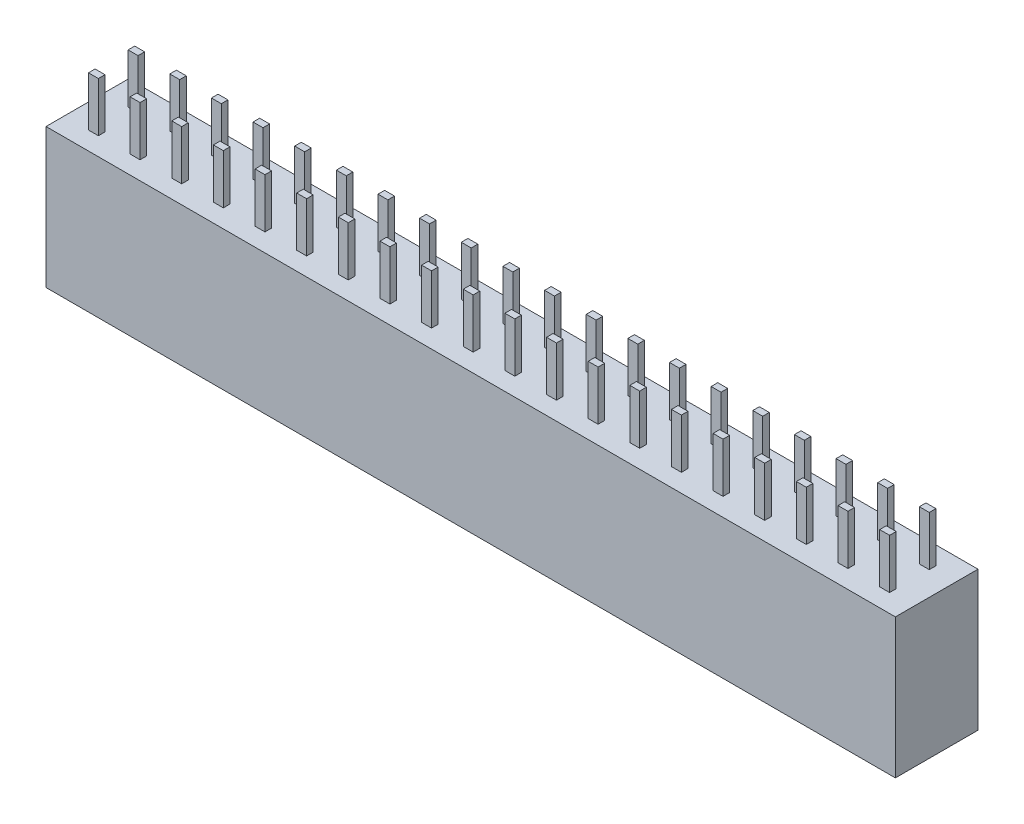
from build123d import *

# Parameters (mm, degrees)
SKETCH1_W           = 51.4
SKETCH1_H           = 5
BOSS_EXTRUDE1_DEPTH = 8.44
SKETCH2_W           = 1.5
SKETCH2_H           = 1.5
CUT_EXTRUDE1_DEPTH  = 5
SKETCH3_W           = 0.6
SKETCH3_H           = 0.4
BOSS_EXTRUDE2_DEPTH = 3


with BuildPart() as part:
    # Sketch1 → Boss-Extrude1 (new body)
    with BuildSketch(Plane(origin=(0, 0, 0), x_dir=(1, 0, 0), z_dir=(0, 1, 0))):
        Rectangle(SKETCH1_W, SKETCH1_H)
    extrude(amount=BOSS_EXTRUDE1_DEPTH)

    # Sketch2 → Cut-Extrude1 (cut)
    with BuildSketch(Plane.XZ):
        with Locations((23.95, 1.25)):
            Rectangle(SKETCH2_W, SKETCH2_H)
        with Locations((23.95, -1.25)):
            Rectangle(SKETCH2_W, SKETCH2_H)
        with Locations((21.43, 1.25)):
            Rectangle(SKETCH2_W, SKETCH2_H)
        with Locations((21.43, -1.25)):
            Rectangle(SKETCH2_W, SKETCH2_H)
        with Locations((18.91, 1.25)):
            Rectangle(SKETCH2_W, SKETCH2_H)
        with Locations((18.91, -1.25)):
            Rectangle(SKETCH2_W, SKETCH2_H)
        with Locations((16.39, 1.25)):
            Rectangle(SKETCH2_W, SKETCH2_H)
        with Locations((16.39, -1.25)):
            Rectangle(SKETCH2_W, SKETCH2_H)
        with Locations((13.87, 1.25)):
            Rectangle(SKETCH2_W, SKETCH2_H)
        with Locations((13.87, -1.25)):
            Rectangle(SKETCH2_W, SKETCH2_H)
        with Locations((11.35, 1.25)):
            Rectangle(SKETCH2_W, SKETCH2_H)
        with Locations((11.35, -1.25)):
            Rectangle(SKETCH2_W, SKETCH2_H)
        with Locations((8.83, 1.25)):
            Rectangle(SKETCH2_W, SKETCH2_H)
        with Locations((8.83, -1.25)):
            Rectangle(SKETCH2_W, SKETCH2_H)
        with Locations((6.31, 1.25)):
            Rectangle(SKETCH2_W, SKETCH2_H)
        with Locations((6.31, -1.25)):
            Rectangle(SKETCH2_W, SKETCH2_H)
        with Locations((3.79, 1.25)):
            Rectangle(SKETCH2_W, SKETCH2_H)
        with Locations((3.79, -1.25)):
            Rectangle(SKETCH2_W, SKETCH2_H)
        with Locations((1.27, 1.25)):
            Rectangle(SKETCH2_W, SKETCH2_H)
        with Locations((1.27, -1.25)):
            Rectangle(SKETCH2_W, SKETCH2_H)
        with Locations((-1.25, 1.25)):
            Rectangle(SKETCH2_W, SKETCH2_H)
        with Locations((-1.25, -1.25)):
            Rectangle(SKETCH2_W, SKETCH2_H)
        with Locations((-3.77, 1.25)):
            Rectangle(SKETCH2_W, SKETCH2_H)
        with Locations((-3.77, -1.25)):
            Rectangle(SKETCH2_W, SKETCH2_H)
        with Locations((-6.29, 1.25)):
            Rectangle(SKETCH2_W, SKETCH2_H)
        with Locations((-6.29, -1.25)):
            Rectangle(SKETCH2_W, SKETCH2_H)
        with Locations((-8.81, 1.25)):
            Rectangle(SKETCH2_W, SKETCH2_H)
        with Locations((-8.81, -1.25)):
            Rectangle(SKETCH2_W, SKETCH2_H)
        with Locations((-11.33, 1.25)):
            Rectangle(SKETCH2_W, SKETCH2_H)
        with Locations((-11.33, -1.25)):
            Rectangle(SKETCH2_W, SKETCH2_H)
        with Locations((-13.85, 1.25)):
            Rectangle(SKETCH2_W, SKETCH2_H)
        with Locations((-13.85, -1.25)):
            Rectangle(SKETCH2_W, SKETCH2_H)
        with Locations((-16.37, 1.25)):
            Rectangle(SKETCH2_W, SKETCH2_H)
        with Locations((-16.37, -1.25)):
            Rectangle(SKETCH2_W, SKETCH2_H)
        with Locations((-18.89, 1.25)):
            Rectangle(SKETCH2_W, SKETCH2_H)
        with Locations((-18.89, -1.25)):
            Rectangle(SKETCH2_W, SKETCH2_H)
        with Locations((-21.41, 1.25)):
            Rectangle(SKETCH2_W, SKETCH2_H)
        with Locations((-21.41, -1.25)):
            Rectangle(SKETCH2_W, SKETCH2_H)
        with Locations((-23.93, 1.25)):
            Rectangle(SKETCH2_W, SKETCH2_H)
        with Locations((-23.93, -1.25)):
            Rectangle(SKETCH2_W, SKETCH2_H)
    extrude(amount=-CUT_EXTRUDE1_DEPTH, mode=Mode.SUBTRACT)

    # Sketch3 → Boss-Extrude2 (add)
    with BuildSketch(Plane(origin=(0, 8.44, 0), x_dir=(1, 0, 0), z_dir=(0, 1, 0))):
        with Locations((23.95, 1.2)):
            Rectangle(SKETCH3_W, SKETCH3_H)
        with Locations((23.95, -1.2)):
            Rectangle(SKETCH3_W, SKETCH3_H)
        with Locations((21.43, 1.2)):
            Rectangle(SKETCH3_W, SKETCH3_H)
        with Locations((21.43, -1.2)):
            Rectangle(SKETCH3_W, SKETCH3_H)
        with Locations((18.91, 1.2)):
            Rectangle(SKETCH3_W, SKETCH3_H)
        with Locations((18.91, -1.2)):
            Rectangle(SKETCH3_W, SKETCH3_H)
        with Locations((16.39, 1.2)):
            Rectangle(SKETCH3_W, SKETCH3_H)
        with Locations((16.39, -1.2)):
            Rectangle(SKETCH3_W, SKETCH3_H)
        with Locations((13.87, 1.2)):
            Rectangle(SKETCH3_W, SKETCH3_H)
        with Locations((13.87, -1.2)):
            Rectangle(SKETCH3_W, SKETCH3_H)
        with Locations((11.35, 1.2)):
            Rectangle(SKETCH3_W, SKETCH3_H)
        with Locations((11.35, -1.2)):
            Rectangle(SKETCH3_W, SKETCH3_H)
        with Locations((8.83, 1.2)):
            Rectangle(SKETCH3_W, SKETCH3_H)
        with Locations((8.83, -1.2)):
            Rectangle(SKETCH3_W, SKETCH3_H)
        with Locations((6.31, 1.2)):
            Rectangle(SKETCH3_W, SKETCH3_H)
        with Locations((6.31, -1.2)):
            Rectangle(SKETCH3_W, SKETCH3_H)
        with Locations((3.79, 1.2)):
            Rectangle(SKETCH3_W, SKETCH3_H)
        with Locations((3.79, -1.2)):
            Rectangle(SKETCH3_W, SKETCH3_H)
        with Locations((1.27, 1.2)):
            Rectangle(SKETCH3_W, SKETCH3_H)
        with Locations((1.27, -1.2)):
            Rectangle(SKETCH3_W, SKETCH3_H)
        with Locations((-1.25, 1.2)):
            Rectangle(SKETCH3_W, SKETCH3_H)
        with Locations((-1.25, -1.2)):
            Rectangle(SKETCH3_W, SKETCH3_H)
        with Locations((-3.77, 1.2)):
            Rectangle(SKETCH3_W, SKETCH3_H)
        with Locations((-3.77, -1.2)):
            Rectangle(SKETCH3_W, SKETCH3_H)
        with Locations((-6.29, 1.2)):
            Rectangle(SKETCH3_W, SKETCH3_H)
        with Locations((-6.29, -1.2)):
            Rectangle(SKETCH3_W, SKETCH3_H)
        with Locations((-8.81, 1.2)):
            Rectangle(SKETCH3_W, SKETCH3_H)
        with Locations((-8.81, -1.2)):
            Rectangle(SKETCH3_W, SKETCH3_H)
        with Locations((-11.33, 1.2)):
            Rectangle(SKETCH3_W, SKETCH3_H)
        with Locations((-11.33, -1.2)):
            Rectangle(SKETCH3_W, SKETCH3_H)
        with Locations((-13.85, 1.2)):
            Rectangle(SKETCH3_W, SKETCH3_H)
        with Locations((-13.85, -1.2)):
            Rectangle(SKETCH3_W, SKETCH3_H)
        with Locations((-16.37, 1.2)):
            Rectangle(SKETCH3_W, SKETCH3_H)
        with Locations((-16.37, -1.2)):
            Rectangle(SKETCH3_W, SKETCH3_H)
        with Locations((-18.89, 1.2)):
            Rectangle(SKETCH3_W, SKETCH3_H)
        with Locations((-18.89, -1.2)):
            Rectangle(SKETCH3_W, SKETCH3_H)
        with Locations((-21.41, 1.2)):
            Rectangle(SKETCH3_W, SKETCH3_H)
        with Locations((-21.41, -1.2)):
            Rectangle(SKETCH3_W, SKETCH3_H)
        with Locations((-23.93, 1.2)):
            Rectangle(SKETCH3_W, SKETCH3_H)
        with Locations((-23.93, -1.2)):
            Rectangle(SKETCH3_W, SKETCH3_H)
    extrude(amount=BOSS_EXTRUDE2_DEPTH)


solid = part.part
